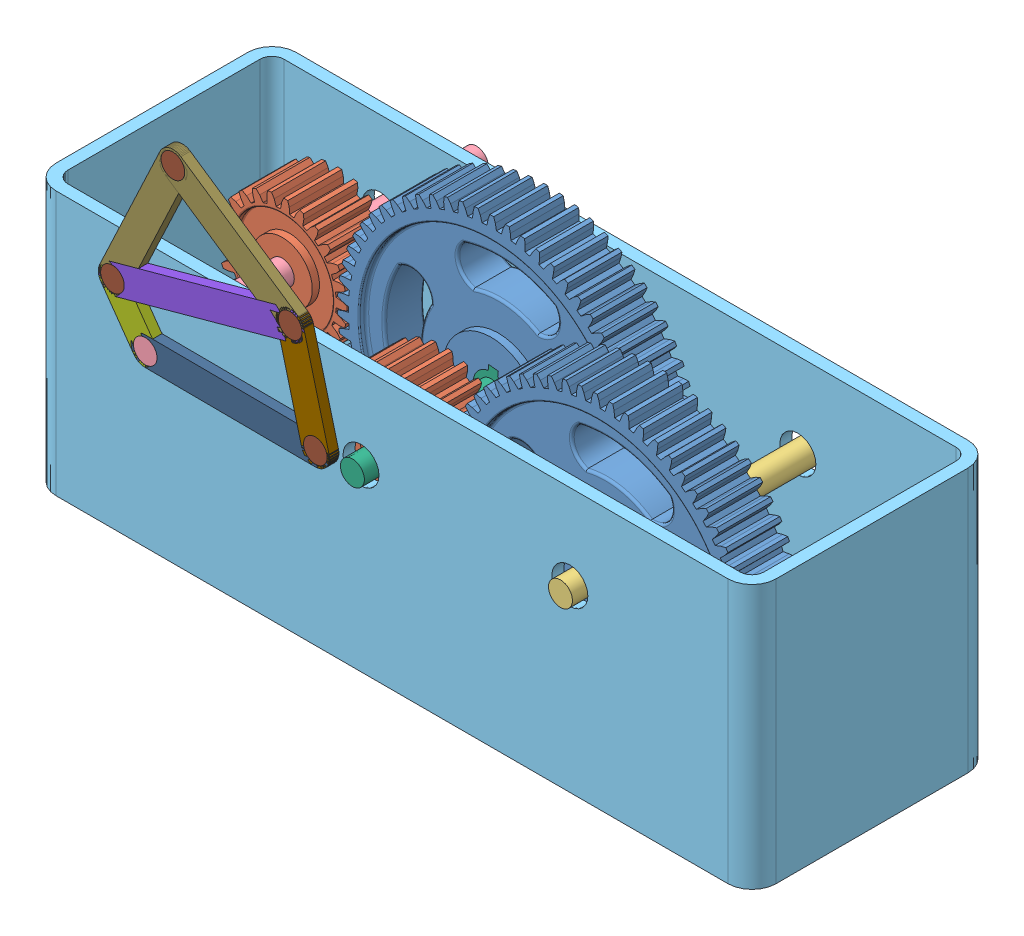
SolidWorks assembly Assem2.SLDASM, configuration Default (file format 15000). Lengths in mm.
Overall size (762 395.23 353.06).
18 component instances, 12 part files, 44 mates.
Components (placement in the parent):
- Gear-1: Gear.SLDPRT [Default] x (0.982826 -0.184537 0) z (0 0 1) size (324.88 325.09 57.15)
- Penion-1: Penion.SLDPRT [Default] at (-220.98 0 0) x (0.994446 -0.105249 0) z (0 0 1) size (137.09 136.82 57.15)
- shaft-2: shaft.SLDPRT [Default] x (0.982826 -0.184537 0) z (0 0 1) size (38.1 43.18 274.32)
- Gear-2: Gear.SLDPRT [Default] at (-220.98 0 -107.95) x (0.994446 -0.105249 0) z (0 0 1) size (324.88 325.09 57.15)
- Penion-3: Penion.SLDPRT [Default] at (-441.96 0 -107.95) x (-0.984125 0.177479 0) z (0 0 1) size (137.09 136.82 57.15)
- Shaft 1-3: Shaft 1.SLDPRT [Default] at (-441.96 0 -186.69) x (-0.984125 0.177479 0) z (0 0 1) size (25.4 29.21 350.52)
- Box-1: Box.SLDPRT [Default] at (-190.7962 -189.6729 -42.7247) size (762 279.4 254)
- shaft 2-4: shaft 2.SLDPRT [Default] at (-220.98 0 0) x (0.994446 -0.105249 0) z (0 0 1) size (38.1 43.18 273.81)
- Part1-2: Part1.SLDPRT [Default] at (-441.96 0 84.234) x (-0.577806 0.816174 0) z (0 0 1) size (90 30 10)
- Part2-2: Part2.SLDPRT [Default] at (-476.6283 48.9705 84.234) x (0.964491 0.264116 0) z (0 0 1) size (225 30 10)
- Part4-2: Part4.SLDPRT [Default] at (-288.5526 100.4731 84.234) x (0.253231 -0.967406 0) z (0 0 1) size (135 30 10)
- Part6-1: Part6.SLDPRT [Default] at (-441.96 0 84.234) x (0.999981 -0.006136 0) z (0 0 1) size (210 30 10)
- pin-4: pin.SLDPRT [Default] at (-261.9634 -1.1046 84.234) x (0.475126 0.879918 0) z (0 0 1) size (25 25 10)
- pin-5: pin.SLDPRT [Default] at (-476.6283 48.9705 84.234) size (25 25 10)
- Part7-1: Part7.SLDPRT [Default] at (-476.6283 48.9705 84.234) x (0.426208 0.904625 0) z (0 0 1) size (180 30 10)
- Part7-2: Part7.SLDPRT [Default] at (-412.6971 184.6642 84.234) x (0.82763 -0.561274 0) z (0 0 1) size (180 30 10)
- pin-6: pin.SLDPRT [Default] at (-412.6971 184.6642 84.234) x (0.957233 0.289319 0) z (0 0 1) size (25 25 10)
- pin-7: pin.SLDPRT [Default] at (-288.5526 100.4731 84.234) x (0.957233 0.289319 0) z (0 0 1) size (25 25 10)
Mates (geometry in assembly coordinates):
- Coincident1: coincident: line of assembly; axis of Gear-1 through (0 0 57.15) axis (0 0 -1); plane of assembly
- Coincident2: coincident: line of assembly; axis of Penion-1 through (-220.98 0 57.15) axis (0 0 -1); plane of assembly
- Coincident3: coincident: line of assembly; axis of Gear-1 through (0 0 57.15) axis (0 0 -1); plane of assembly
- Distance2: distance = 220.98 mm: line of assembly; axis of Penion-1 through (-220.98 0 57.15) axis (0 0 -1); plane of assembly
- Coincident6: coincident anti-aligned: plane of Gear-1 through (0 0 0) normal (0 0 -1)
- Coincident7: coincident: plane of assembly through (0 0 0) normal (0 0 1); plane of Penion-1 through (-220.98 0 0) normal (0 0 -1); plane of assembly
- GearMate1: gear = 1574.8 mm: cylinder of Penion-1 through (-220.98 0 -51.308) axis (0 0 1) radius 12.7; cylinder of Gear-1 through (0 0 -101.346) axis (0 0 1) radius 19.05
- Concentric10: concentric anti-aligned: cylinder of Gear-1 through (0 0 -101.346) axis (0 0 1) radius 19.05; cylinder of shaft-2 through (0 0 57.15) axis (0 0 -1) radius 19.05
- Coincident12: coincident aligned: line of Gear-1 through (24.5671 2.126 57.15) axis (-0.289611 0.957145 0); line of shaft-2 through (24.5671 2.126 57.15) axis (-0.289611 0.957145 0)
- Coincident19: coincident aligned: plane of Gear-2 through (-220.98 0 -50.8) normal (0 0 1); plane of Penion-3 through (-441.96 0 -50.8) normal (0 0 1)
- Coincident21: coincident: line of assembly; axis of Penion-3 through (-441.96 0 -107.95) axis (0 0 1); plane of assembly
- Concentric13: concentric anti-aligned: cylinder of Penion-3 through (-441.96 0 -159.258) axis (0 0 1) radius 12.7; cylinder of Shaft 1-3 through (-441.96 0 -50.8) axis (0 0 -1) radius 12.7
- Coincident22: coincident aligned: line of Penion-3 through (-454.514 -11.3795 -50.8) axis (0.820999 -0.570929 0); line of Shaft 1-3 through (-454.514 -11.3795 -50.8) axis (0.820999 -0.570929 0)
- Concentric15: concentric anti-aligned: line of Penion-1 through (-220.98 0 0) axis (0 0 1); cylinder of shaft 2-4 through (-220.98 0 57.15) axis (0 0 -1) radius 12.7
- Coincident25: coincident aligned: line of Penion-1 through (-232.7414 -12.1969 57.15) axis (0.85749 -0.5145 0); line of shaft 2-4 through (-232.7414 -12.1969 57.15) axis (0.85749 -0.5145 0)
- Coincident26: coincident anti-aligned: line of Gear-2 through (-237.7509 -18.0776 -50.8) axis (0.85749 -0.5145 0); line of shaft 2-4 through (-229.0388 -23.3049 -50.8) axis (-0.85749 0.5145 0)
- Concentric16: concentric aligned: line of Gear-2 through (-220.98 0 -107.95) axis (0 0 1); cylinder of shaft 2-4 through (-220.98 0 -114.3) axis (0 0 1) radius 19.05
- Distance3: distance = 220.98 mm: line of assembly; line of assembly; axis of Penion-1 through (-220.98 0 0) axis (0 0 1); axis of Penion-3 through (-441.96 0 -107.95) axis (0 0 1)
- GearMate2: gear = 1574.8 mm: cylinder of Penion-3 through (-441.96 0 -50.8) axis (0 0 -1) radius 57.15; cylinder of Gear-2 through (-220.98 0 -50.8) axis (0 0 -1) radius 151.13
- Concentric24: concentric aligned: cylinder of Shaft 1-3 through (-441.96 0 -50.8) axis (0 0 -1) radius 12.7; cylinder of Part1-2 through (-441.96 0 94.234) axis (0 0 -1) radius 12.5
- Concentric25: concentric aligned: cylinder of Part1-2 through (-453.1044 58.9559 94.234) axis (0 0 -1) radius 12.5; cylinder of Part2-2 through (-453.1044 58.9559 94.234) axis (0 0 -1) radius 12.5
- Coincident41: coincident aligned: plane of Part1-2 through (-441.96 0 94.234) normal (0 0 1); plane of Part2-2 through (-453.1044 58.9559 94.234) normal (0 0 1)
- Concentric26: concentric aligned: cylinder of Part2-2 through (-263.3512 103.8863 94.234) axis (0 0 -1) radius 12.5; cylinder of Part4-2 through (-263.3512 103.8863 94.234) axis (0 0 -1) radius 12.5
- Coincident42: coincident aligned: plane of Part2-2 through (-453.1044 58.9559 94.234) normal (0 0 1); plane of Part4-2 through (-263.3512 103.8863 94.234) normal (0 0 1)
- Concentric33: concentric: cylinder of Part1-2 through (-441.96 0 94.234) axis (0 0 -1) radius 12.5; cylinder of Part6-1 through (-441.96 0 94.234) axis (0 0 -1) radius 12.5
- Coincident49: coincident aligned: plane of Part1-2 through (-441.96 0 94.234) normal (0 0 1); plane of Part6-1 through (-441.96 0 94.234) normal (0 0 1)
- Coincident50: coincident aligned: plane of Shaft 1-3 through (-441.96 0 94.234) normal (0 0 1); plane of Part6-1 through (-441.96 0 94.234) normal (0 0 1)
- Concentric34: concentric aligned: cylinder of Part4-2 through (-261.9634 -1.1046 94.234) axis (0 0 -1) radius 12.5; cylinder of Part6-1 through (-261.9634 -1.1046 94.234) axis (0 0 -1) radius 12.5
- Coincident51: coincident aligned: plane of Part4-2 through (-263.3512 103.8863 94.234) normal (0 0 1); plane of Part6-1 through (-441.96 0 94.234) normal (0 0 1)
- Concentric35: concentric aligned: cylinder of Part6-1 through (-261.9634 -1.1046 94.234) axis (0 0 -1) radius 12.5; cylinder of pin-4 through (-261.9634 -1.1046 94.234) axis (0 0 -1) radius 12.5
- Coincident52: coincident aligned: plane of Part6-1 through (-441.96 0 94.234) normal (0 0 1); plane of pin-4 through (-261.9634 -1.1046 94.234) normal (0 0 1)
- Lock3: lock: unknown of Shaft 1-3; unknown of Part1-2
- Concentric37: concentric aligned: cylinder of Part1-2 through (-453.1044 58.9559 94.234) axis (0 0 -1) radius 12.5; cylinder of Part7-1 through (-453.1044 58.9559 94.234) axis (0 0 -1) radius 12.5
- Coincident56: coincident aligned: plane of Part2-2 through (-453.1044 58.9559 94.234) normal (0 0 1); plane of Part7-1 through (-453.1044 58.9559 94.234) normal (0 0 1)
- Concentric38: concentric aligned: cylinder of Part7-1 through (-384.4925 192.3441 94.234) axis (0 0 -1) radius 12.5; cylinder of Part7-2 through (-384.4925 192.3441 94.234) axis (0 0 -1) radius 12.5
- Coincident57: coincident aligned: plane of Part7-1 through (-453.1044 58.9559 94.234) normal (0 0 1); plane of Part7-2 through (-384.4925 192.3441 94.234) normal (0 0 1)
- Concentric40: concentric aligned: cylinder of Part2-2 through (-263.3512 103.8863 94.234) axis (0 0 -1) radius 12.5; cylinder of Part7-2 through (-263.3512 103.8863 94.234) axis (0 0 -1) radius 12.5
- Coincident58: coincident aligned: plane of Part2-2 through (-453.1044 58.9559 94.234) normal (0 0 1); plane of Part7-2 through (-384.4925 192.3441 94.234) normal (0 0 1)
- Concentric41: concentric aligned: cylinder of Part1-2 through (-453.1044 58.9559 94.234) axis (0 0 -1) radius 12.5; cylinder of pin-5 through (-453.1044 58.9559 94.234) axis (0 0 -1) radius 12.5
- Coincident59: coincident aligned: plane of Part2-2 through (-453.1044 58.9559 94.234) normal (0 0 1); plane of pin-5 through (-453.1044 58.9559 94.234) normal (0 0 1)
- Concentric42: concentric aligned: cylinder of Part7-1 through (-384.4925 192.3441 94.234) axis (0 0 -1) radius 12.5; cylinder of pin-6 through (-384.4925 192.3441 94.234) axis (0 0 -1) radius 12.5
- Coincident60: coincident aligned: plane of Part7-2 through (-384.4925 192.3441 94.234) normal (0 0 1); plane of pin-6 through (-384.4925 192.3441 94.234) normal (0 0 1)
- Concentric43: concentric aligned: cylinder of Part4-2 through (-263.3512 103.8863 94.234) axis (0 0 -1) radius 12.5; cylinder of pin-7 through (-263.3512 103.8863 94.234) axis (0 0 -1) radius 12.5
- Coincident61: coincident aligned: plane of Part7-2 through (-384.4925 192.3441 94.234) normal (0 0 1); plane of pin-7 through (-263.3512 103.8863 94.234) normal (0 0 1)
